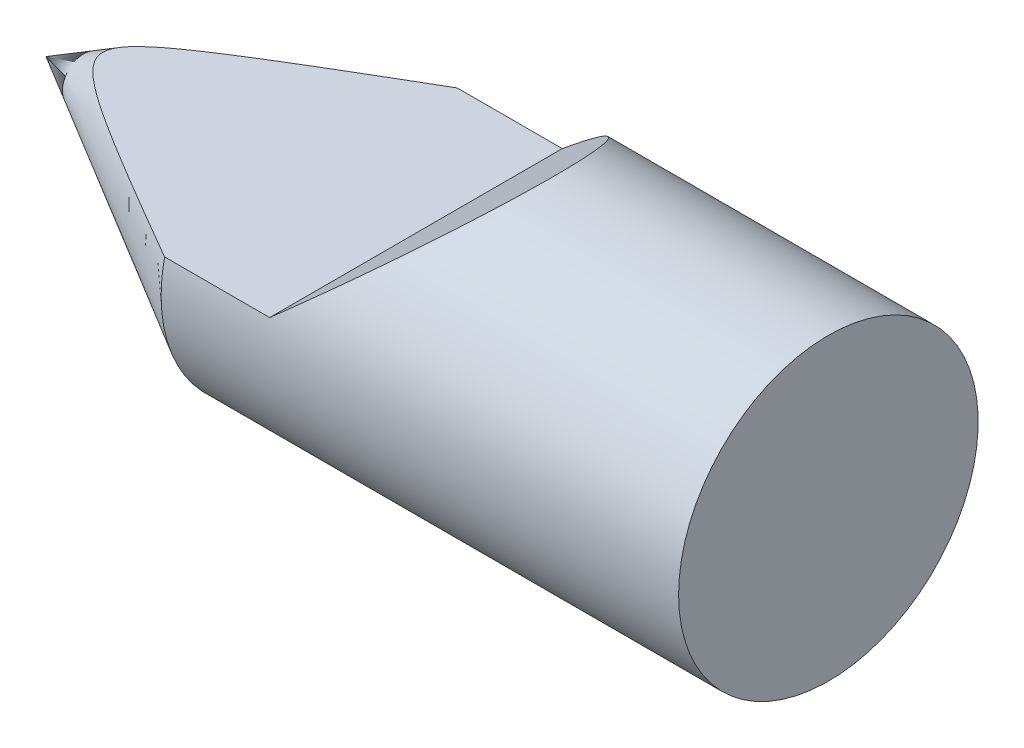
from build123d import *

# Parameters (mm, degrees)
CUT_EXTRUDE_1_DEPTH      = 70.511038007
CUT_EXTRUDE_1_DEPTH_BACK = 70.511038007


with BuildPart() as part:
    # Sketch 1 → Revolve 1 (revolve)
    with BuildSketch(Plane.XY, mode=Mode.PRIVATE) as revolve_1_sk:
        Polygon((-64.700572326, 0), (-32.92436875, 17.966918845), (29.143169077, 17.966918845), (29.143169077, 0), align=None)
    revolve(revolve_1_sk.sketch.rotate(Axis((-78.06439626, 0, 0), (1, 0, 0)), 90), axis=Axis((-78.06439626, 0, 0), (1, 0, 0)))

    # Sketch 2 → Cut-Extrude 1 (cut, two sides: drawn at the far end of the back side and taken through both)
    with BuildSketch(Plane.XY.offset(-CUT_EXTRUDE_1_DEPTH_BACK)):
        Polygon((2.778777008, 23.638138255), (-20.326170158, 3.850824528), (-66.062116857, 3.850824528), (-42.009274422, 23.638138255), align=None)
    extrude(amount=CUT_EXTRUDE_1_DEPTH + CUT_EXTRUDE_1_DEPTH_BACK, mode=Mode.SUBTRACT)


solid = part.part
